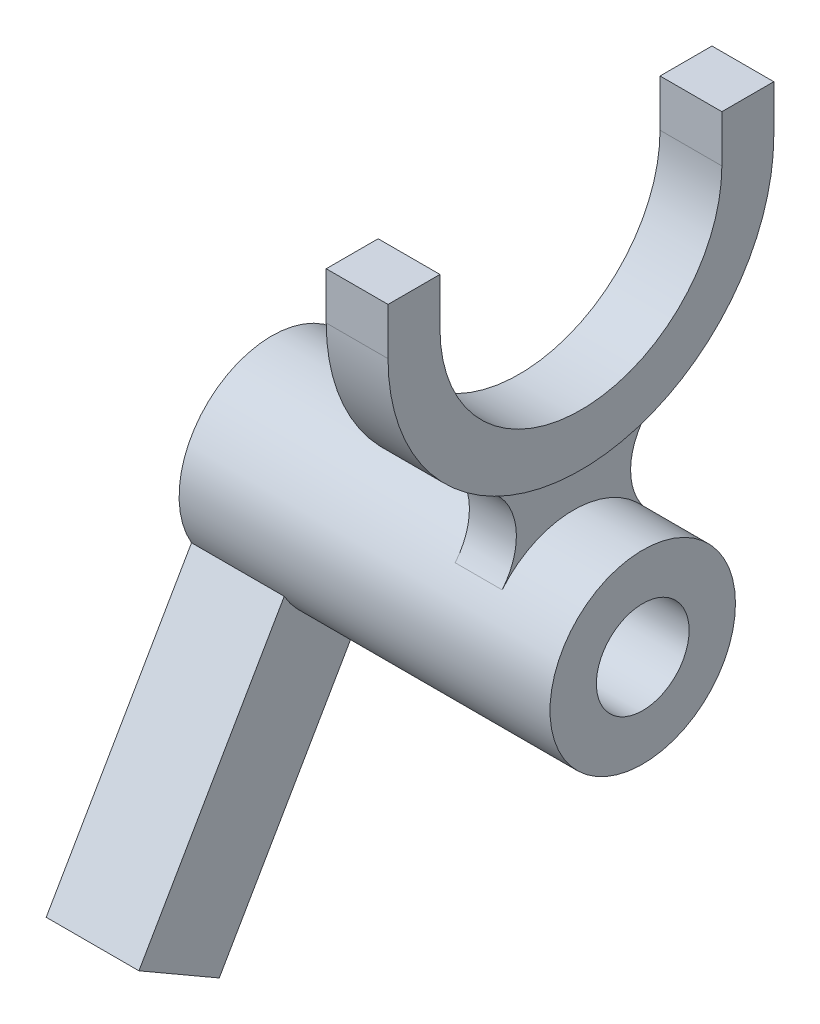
ISO-10303-21;
HEADER;
FILE_DESCRIPTION(('STEP AP214'),'2;1');
FILE_NAME('part.step','',(''),(''),'','','');
FILE_SCHEMA(('AUTOMOTIVE_DESIGN { 1 0 10303 214 1 1 1 1 }'));
ENDSEC;
DATA;
#1=APPLICATION_CONTEXT('core data for automotive mechanical design processes');
#2=APPLICATION_PROTOCOL_DEFINITION('international standard','automotive_design',2000,#1);
#3=PRODUCT_CONTEXT('',#1,'mechanical');
#4=PRODUCT('Part','Part','',(#3));
#5=PRODUCT_RELATED_PRODUCT_CATEGORY('part','',(#4));
#6=PRODUCT_DEFINITION_FORMATION('','',#4);
#7=PRODUCT_DEFINITION_CONTEXT('part definition',#1,'design');
#8=PRODUCT_DEFINITION('design','',#6,#7);
#9=PRODUCT_DEFINITION_SHAPE('','',#8);
#10=(LENGTH_UNIT() NAMED_UNIT(*) SI_UNIT(.MILLI.,.METRE.));
#11=(NAMED_UNIT(*) PLANE_ANGLE_UNIT() SI_UNIT($,.RADIAN.));
#12=(NAMED_UNIT(*) SI_UNIT($,.STERADIAN.) SOLID_ANGLE_UNIT());
#13=UNCERTAINTY_MEASURE_WITH_UNIT(LENGTH_MEASURE(1.E-05),#10,'distance_accuracy_value','');
#14=(GEOMETRIC_REPRESENTATION_CONTEXT(3) GLOBAL_UNCERTAINTY_ASSIGNED_CONTEXT((#13)) GLOBAL_UNIT_ASSIGNED_CONTEXT((#10,
#11,#12)) REPRESENTATION_CONTEXT('',''));
#15=CARTESIAN_POINT('',(0.,0.,0.));
#16=DIRECTION('',(0.,0.,1.));
#17=DIRECTION('',(1.,0.,0.));
#18=AXIS2_PLACEMENT_3D('',#15,#16,#17);
#19=CARTESIAN_POINT('',(-57.15,0.,0.));
#20=DIRECTION('',(1.,0.,0.));
#21=DIRECTION('',(0.,0.,-1.));
#22=AXIS2_PLACEMENT_3D('',#19,#20,#21);
#23=CYLINDRICAL_SURFACE('',#22,19.05);
#24=DIRECTION('',(-1.,0.,0.));
#25=VECTOR('',#24,1.);
#26=CARTESIAN_POINT('',(-38.1,-19.05,0.));
#27=LINE('',#26,#25);
#28=CARTESIAN_POINT('',(-38.1,-19.05,0.));
#29=VERTEX_POINT('',#28);
#30=CARTESIAN_POINT('',(-57.15,-19.05,0.));
#31=VERTEX_POINT('',#30);
#32=EDGE_CURVE('E176',#29,#31,#27,.T.);
#33=ORIENTED_EDGE('',*,*,#32,.T.);
#34=CARTESIAN_POINT('',(-57.15,0.,0.));
#35=DIRECTION('',(1.,0.,0.));
#36=DIRECTION('',(0.,0.,-1.));
#37=AXIS2_PLACEMENT_3D('',#34,#35,#36);
#38=CIRCLE('',#37,19.05);
#39=CARTESIAN_POINT('',(-57.15,-9.52499999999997,16.4977839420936));
#40=VERTEX_POINT('',#39);
#41=EDGE_CURVE('E11',#31,#40,#38,.T.);
#42=ORIENTED_EDGE('',*,*,#41,.T.);
#43=DIRECTION('',(-1.,0.,0.));
#44=VECTOR('',#43,1.);
#45=CARTESIAN_POINT('',(-38.1,-9.52499999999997,16.4977839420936));
#46=LINE('',#45,#44);
#47=CARTESIAN_POINT('',(-38.1,-9.52499999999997,16.4977839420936));
#48=VERTEX_POINT('',#47);
#49=EDGE_CURVE('E51',#48,#40,#46,.T.);
#50=ORIENTED_EDGE('',*,*,#49,.F.);
#51=CARTESIAN_POINT('',(-38.1,0.,0.));
#52=DIRECTION('',(1.,0.,0.));
#53=DIRECTION('',(0.,0.,1.));
#54=AXIS2_PLACEMENT_3D('',#51,#52,#53);
#55=CIRCLE('',#54,19.05);
#56=EDGE_CURVE('E47',#48,#29,#55,.T.);
#57=ORIENTED_EDGE('',*,*,#56,.T.);
#58=EDGE_LOOP('',(#33,#42,#50,#57));
#59=FACE_BOUND('',#58,.T.);
#60=CARTESIAN_POINT('',(4.826,0.,0.));
#61=DIRECTION('',(-1.,0.,0.));
#62=DIRECTION('',(0.,0.,-1.));
#63=AXIS2_PLACEMENT_3D('',#60,#61,#62);
#64=CIRCLE('',#63,19.05);
#65=CARTESIAN_POINT('',(4.826,12.1666969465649,14.6585806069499));
#66=VERTEX_POINT('',#65);
#67=CARTESIAN_POINT('',(4.826,12.1666969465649,-14.6585806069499));
#68=VERTEX_POINT('',#67);
#69=EDGE_CURVE('E246',#66,#68,#64,.T.);
#70=ORIENTED_EDGE('',*,*,#69,.F.);
#71=DIRECTION('',(-1.,0.,0.));
#72=VECTOR('',#71,1.);
#73=CARTESIAN_POINT('',(4.826,12.1666969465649,14.6585806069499));
#74=LINE('',#73,#72);
#75=CARTESIAN_POINT('',(-4.826,12.1666969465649,14.6585806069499));
#76=VERTEX_POINT('',#75);
#77=EDGE_CURVE('E264',#66,#76,#74,.T.);
#78=ORIENTED_EDGE('',*,*,#77,.T.);
#79=CARTESIAN_POINT('',(-4.826,0.,0.));
#80=DIRECTION('',(-1.,0.,0.));
#81=DIRECTION('',(0.,0.,-1.));
#82=AXIS2_PLACEMENT_3D('',#79,#80,#81);
#83=CIRCLE('',#82,19.05);
#84=CARTESIAN_POINT('',(-4.826,12.1666969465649,-14.6585806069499));
#85=VERTEX_POINT('',#84);
#86=EDGE_CURVE('E255',#76,#85,#83,.T.);
#87=ORIENTED_EDGE('',*,*,#86,.T.);
#88=DIRECTION('',(-1.,0.,0.));
#89=VECTOR('',#88,1.);
#90=CARTESIAN_POINT('',(4.826,12.1666969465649,-14.6585806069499));
#91=LINE('',#90,#89);
#92=EDGE_CURVE('E261',#68,#85,#91,.T.);
#93=ORIENTED_EDGE('',*,*,#92,.F.);
#94=EDGE_LOOP('',(#70,#78,#87,#93));
#95=FACE_BOUND('',#94,.T.);
#96=CARTESIAN_POINT('',(19.05,0.,0.));
#97=DIRECTION('',(1.,0.,0.));
#98=DIRECTION('',(0.,0.,-1.));
#99=AXIS2_PLACEMENT_3D('',#96,#97,#98);
#100=CIRCLE('',#99,19.05);
#101=CARTESIAN_POINT('',(19.05,0.,-19.05));
#102=VERTEX_POINT('',#101);
#103=EDGE_CURVE('E272',#102,#102,#100,.T.);
#104=ORIENTED_EDGE('',*,*,#103,.F.);
#105=EDGE_LOOP('',(#104));
#106=FACE_BOUND('',#105,.T.);
#107=ADVANCED_FACE('F33',(#59,#95,#106),#23,.T.);
#108=CARTESIAN_POINT('',(-57.15,0.,0.));
#109=DIRECTION('',(1.,0.,0.));
#110=DIRECTION('',(0.,0.,-1.));
#111=AXIS2_PLACEMENT_3D('',#108,#109,#110);
#112=PLANE('',#111);
#113=CARTESIAN_POINT('',(-57.15,0.,0.));
#114=DIRECTION('',(1.,0.,0.));
#115=DIRECTION('',(0.,0.,-1.));
#116=AXIS2_PLACEMENT_3D('',#113,#114,#115);
#117=CIRCLE('',#116,9.525);
#118=CARTESIAN_POINT('',(-57.15,0.,-9.525));
#119=VERTEX_POINT('',#118);
#120=EDGE_CURVE('E40',#119,#119,#117,.T.);
#121=ORIENTED_EDGE('',*,*,#120,.T.);
#122=EDGE_LOOP('',(#121));
#123=FACE_BOUND('',#122,.T.);
#124=ORIENTED_EDGE('',*,*,#41,.F.);
#125=DIRECTION('',(0.,-0.866025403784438,0.500000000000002));
#126=VECTOR('',#125,1.);
#127=CARTESIAN_POINT('',(-57.15,-70.7536357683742,29.8511080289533));
#128=LINE('',#127,#126);
#129=CARTESIAN_POINT('',(-57.15,-70.7536357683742,29.8511080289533));
#130=VERTEX_POINT('',#129);
#131=EDGE_CURVE('E164',#31,#130,#128,.T.);
#132=ORIENTED_EDGE('',*,*,#131,.T.);
#133=DIRECTION('',(0.,0.500000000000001,0.866025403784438));
#134=VECTOR('',#133,1.);
#135=CARTESIAN_POINT('',(-57.15,-61.2286357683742,46.3488919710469));
#136=LINE('',#135,#134);
#137=CARTESIAN_POINT('',(-57.15,-61.2286357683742,46.3488919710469));
#138=VERTEX_POINT('',#137);
#139=EDGE_CURVE('E171',#130,#138,#136,.T.);
#140=ORIENTED_EDGE('',*,*,#139,.T.);
#141=DIRECTION('',(0.,0.866025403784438,-0.500000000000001));
#142=VECTOR('',#141,1.);
#143=CARTESIAN_POINT('',(-57.15,-61.2286357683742,46.3488919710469));
#144=LINE('',#143,#142);
#145=EDGE_CURVE('E148',#138,#40,#144,.T.);
#146=ORIENTED_EDGE('',*,*,#145,.T.);
#147=EDGE_LOOP('',(#124,#132,#140,#146));
#148=FACE_BOUND('',#147,.T.);
#149=ADVANCED_FACE('F277',(#123,#148),#112,.F.);
#150=CARTESIAN_POINT('',(-57.15,0.,0.));
#151=DIRECTION('',(1.,0.,0.));
#152=DIRECTION('',(0.,0.,-1.));
#153=AXIS2_PLACEMENT_3D('',#150,#151,#152);
#154=CYLINDRICAL_SURFACE('',#153,9.525);
#155=ORIENTED_EDGE('',*,*,#120,.F.);
#156=EDGE_LOOP('',(#155));
#157=FACE_BOUND('',#156,.T.);
#158=CARTESIAN_POINT('',(19.05,0.,0.));
#159=DIRECTION('',(1.,0.,0.));
#160=DIRECTION('',(0.,0.,-1.));
#161=AXIS2_PLACEMENT_3D('',#158,#159,#160);
#162=CIRCLE('',#161,9.525);
#163=CARTESIAN_POINT('',(19.05,0.,-9.525));
#164=VERTEX_POINT('',#163);
#165=EDGE_CURVE('E269',#164,#164,#162,.T.);
#166=ORIENTED_EDGE('',*,*,#165,.T.);
#167=EDGE_LOOP('',(#166));
#168=FACE_BOUND('',#167,.T.);
#169=ADVANCED_FACE('F280',(#157,#168),#154,.F.);
#170=CARTESIAN_POINT('',(19.05,0.,0.));
#171=DIRECTION('',(1.,0.,0.));
#172=DIRECTION('',(0.,0.,-1.));
#173=AXIS2_PLACEMENT_3D('',#170,#171,#172);
#174=PLANE('',#173);
#175=ORIENTED_EDGE('',*,*,#103,.T.);
#176=EDGE_LOOP('',(#175));
#177=FACE_BOUND('',#176,.T.);
#178=ORIENTED_EDGE('',*,*,#165,.F.);
#179=EDGE_LOOP('',(#178));
#180=FACE_BOUND('',#179,.T.);
#181=ADVANCED_FACE('F283',(#177,#180),#174,.T.);
#182=CARTESIAN_POINT('',(4.826,20.2778282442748,24.4309676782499));
#183=DIRECTION('',(-1.,0.,0.));
#184=DIRECTION('',(0.,0.,1.));
#185=AXIS2_PLACEMENT_3D('',#182,#183,#184);
#186=CYLINDRICAL_SURFACE('',#185,12.7);
#187=CARTESIAN_POINT('',(-4.826,20.2778282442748,24.4309676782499));
#188=DIRECTION('',(-1.,0.,0.));
#189=DIRECTION('',(0.,0.,1.));
#190=AXIS2_PLACEMENT_3D('',#187,#188,#189);
#191=CIRCLE('',#190,12.7);
#192=CARTESIAN_POINT('',(-4.826,31.5084524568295,18.5011211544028));
#193=VERTEX_POINT('',#192);
#194=EDGE_CURVE('E253',#193,#76,#191,.T.);
#195=ORIENTED_EDGE('',*,*,#194,.T.);
#196=ORIENTED_EDGE('',*,*,#77,.F.);
#197=CARTESIAN_POINT('',(4.826,20.2778282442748,24.4309676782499));
#198=DIRECTION('',(-1.,0.,0.));
#199=DIRECTION('',(0.,0.,1.));
#200=AXIS2_PLACEMENT_3D('',#197,#198,#199);
#201=CIRCLE('',#200,12.7);
#202=CARTESIAN_POINT('',(4.826,31.5084524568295,18.5011211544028));
#203=VERTEX_POINT('',#202);
#204=EDGE_CURVE('E243',#203,#66,#201,.T.);
#205=ORIENTED_EDGE('',*,*,#204,.F.);
#206=DIRECTION('',(-1.,0.,0.));
#207=VECTOR('',#206,1.);
#208=CARTESIAN_POINT('',(4.826,31.5084524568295,18.5011211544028));
#209=LINE('',#208,#207);
#210=EDGE_CURVE('E267',#203,#193,#209,.T.);
#211=ORIENTED_EDGE('',*,*,#210,.T.);
#212=EDGE_LOOP('',(#195,#196,#205,#211));
#213=FACE_BOUND('',#212,.T.);
#214=ADVANCED_FACE('F288',(#213),#186,.F.);
#215=CARTESIAN_POINT('',(4.826,20.2778282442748,-24.4309676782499));
#216=DIRECTION('',(-1.,0.,0.));
#217=DIRECTION('',(0.,0.,1.));
#218=AXIS2_PLACEMENT_3D('',#215,#216,#217);
#219=CYLINDRICAL_SURFACE('',#218,12.7);
#220=CARTESIAN_POINT('',(-4.826,20.2778282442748,-24.4309676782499));
#221=DIRECTION('',(-1.,0.,0.));
#222=DIRECTION('',(0.,0.,-1.));
#223=AXIS2_PLACEMENT_3D('',#220,#221,#222);
#224=CIRCLE('',#223,12.7);
#225=CARTESIAN_POINT('',(-4.826,31.5084524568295,-18.5011211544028));
#226=VERTEX_POINT('',#225);
#227=EDGE_CURVE('E244',#85,#226,#224,.T.);
#228=ORIENTED_EDGE('',*,*,#227,.T.);
#229=DIRECTION('',(-1.,0.,0.));
#230=VECTOR('',#229,1.);
#231=CARTESIAN_POINT('',(4.826,31.5084524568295,-18.5011211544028));
#232=LINE('',#231,#230);
#233=CARTESIAN_POINT('',(4.826,31.5084524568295,-18.5011211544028));
#234=VERTEX_POINT('',#233);
#235=EDGE_CURVE('E250',#234,#226,#232,.T.);
#236=ORIENTED_EDGE('',*,*,#235,.F.);
#237=CARTESIAN_POINT('',(4.826,20.2778282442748,-24.4309676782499));
#238=DIRECTION('',(-1.,0.,0.));
#239=DIRECTION('',(0.,0.,-1.));
#240=AXIS2_PLACEMENT_3D('',#237,#238,#239);
#241=CIRCLE('',#240,12.7);
#242=EDGE_CURVE('E248',#68,#234,#241,.T.);
#243=ORIENTED_EDGE('',*,*,#242,.F.);
#244=ORIENTED_EDGE('',*,*,#92,.T.);
#245=EDGE_LOOP('',(#228,#236,#243,#244));
#246=FACE_BOUND('',#245,.T.);
#247=ADVANCED_FACE('F294',(#246),#219,.F.);
#248=CARTESIAN_POINT('',(4.826,43.4129141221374,-12.2154838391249));
#249=DIRECTION('',(1.,0.,0.));
#250=DIRECTION('',(0.,0.,-1.));
#251=AXIS2_PLACEMENT_3D('',#248,#249,#250);
#252=PLANE('',#251);
#253=CARTESIAN_POINT('',(4.826,66.548,0.));
#254=DIRECTION('',(-1.,0.,0.));
#255=DIRECTION('',(0.,0.,-1.));
#256=AXIS2_PLACEMENT_3D('',#253,#254,#255);
#257=CIRCLE('',#256,39.624);
#258=EDGE_CURVE('E240',#234,#203,#257,.T.);
#259=ORIENTED_EDGE('',*,*,#258,.T.);
#260=ORIENTED_EDGE('',*,*,#204,.T.);
#261=ORIENTED_EDGE('',*,*,#69,.T.);
#262=ORIENTED_EDGE('',*,*,#242,.T.);
#263=EDGE_LOOP('',(#259,#260,#261,#262));
#264=FACE_BOUND('',#263,.T.);
#265=ADVANCED_FACE('F310',(#264),#252,.T.);
#266=CARTESIAN_POINT('',(-4.826,43.4129141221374,-12.2154838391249));
#267=DIRECTION('',(1.,0.,0.));
#268=DIRECTION('',(0.,0.,-1.));
#269=AXIS2_PLACEMENT_3D('',#266,#267,#268);
#270=PLANE('',#269);
#271=CARTESIAN_POINT('',(-4.826,66.548,0.));
#272=DIRECTION('',(-1.,0.,0.));
#273=DIRECTION('',(0.,0.,-1.));
#274=AXIS2_PLACEMENT_3D('',#271,#272,#273);
#275=CIRCLE('',#274,39.624);
#276=EDGE_CURVE('E239',#226,#193,#275,.T.);
#277=ORIENTED_EDGE('',*,*,#276,.F.);
#278=ORIENTED_EDGE('',*,*,#227,.F.);
#279=ORIENTED_EDGE('',*,*,#86,.F.);
#280=ORIENTED_EDGE('',*,*,#194,.F.);
#281=EDGE_LOOP('',(#277,#278,#279,#280));
#282=FACE_BOUND('',#281,.T.);
#283=ADVANCED_FACE('F322',(#282),#270,.F.);
#284=CARTESIAN_POINT('',(6.35,66.548,-39.624));
#285=DIRECTION('',(0.,0.,1.));
#286=DIRECTION('',(1.,0.,0.));
#287=AXIS2_PLACEMENT_3D('',#284,#285,#286);
#288=PLANE('',#287);
#289=DIRECTION('',(0.,1.,0.));
#290=VECTOR('',#289,1.);
#291=CARTESIAN_POINT('',(-6.35,66.548,-39.624));
#292=LINE('',#291,#290);
#293=CARTESIAN_POINT('',(-6.35,66.548,-39.624));
#294=VERTEX_POINT('',#293);
#295=CARTESIAN_POINT('',(-6.35,76.2,-39.624));
#296=VERTEX_POINT('',#295);
#297=EDGE_CURVE('E175',#294,#296,#292,.T.);
#298=ORIENTED_EDGE('',*,*,#297,.T.);
#299=DIRECTION('',(-1.,0.,0.));
#300=VECTOR('',#299,1.);
#301=CARTESIAN_POINT('',(6.35,76.2,-39.624));
#302=LINE('',#301,#300);
#303=CARTESIAN_POINT('',(6.35,76.2,-39.624));
#304=VERTEX_POINT('',#303);
#305=EDGE_CURVE('E237',#304,#296,#302,.T.);
#306=ORIENTED_EDGE('',*,*,#305,.F.);
#307=DIRECTION('',(0.,1.,0.));
#308=VECTOR('',#307,1.);
#309=CARTESIAN_POINT('',(6.35,66.548,-39.624));
#310=LINE('',#309,#308);
#311=CARTESIAN_POINT('',(6.35,66.548,-39.624));
#312=VERTEX_POINT('',#311);
#313=EDGE_CURVE('E179',#312,#304,#310,.T.);
#314=ORIENTED_EDGE('',*,*,#313,.F.);
#315=DIRECTION('',(-1.,0.,0.));
#316=VECTOR('',#315,1.);
#317=CARTESIAN_POINT('',(6.35,66.548,-39.624));
#318=LINE('',#317,#316);
#319=EDGE_CURVE('E201',#312,#294,#318,.T.);
#320=ORIENTED_EDGE('',*,*,#319,.T.);
#321=EDGE_LOOP('',(#298,#306,#314,#320));
#322=FACE_BOUND('',#321,.T.);
#323=ADVANCED_FACE('F324',(#322),#288,.F.);
#324=CARTESIAN_POINT('',(6.35,76.2,-28.956));
#325=DIRECTION('',(0.,1.,0.));
#326=DIRECTION('',(0.,0.,1.));
#327=AXIS2_PLACEMENT_3D('',#324,#325,#326);
#328=PLANE('',#327);
#329=DIRECTION('',(0.,0.,-1.));
#330=VECTOR('',#329,1.);
#331=CARTESIAN_POINT('',(-6.35,76.2,-28.956));
#332=LINE('',#331,#330);
#333=CARTESIAN_POINT('',(-6.35,76.2,-28.956));
#334=VERTEX_POINT('',#333);
#335=EDGE_CURVE('E204',#334,#296,#332,.T.);
#336=ORIENTED_EDGE('',*,*,#335,.F.);
#337=DIRECTION('',(-1.,0.,0.));
#338=VECTOR('',#337,1.);
#339=CARTESIAN_POINT('',(6.35,76.2,-28.956));
#340=LINE('',#339,#338);
#341=CARTESIAN_POINT('',(6.35,76.2,-28.956));
#342=VERTEX_POINT('',#341);
#343=EDGE_CURVE('E235',#342,#334,#340,.T.);
#344=ORIENTED_EDGE('',*,*,#343,.F.);
#345=DIRECTION('',(0.,0.,-1.));
#346=VECTOR('',#345,1.);
#347=CARTESIAN_POINT('',(6.35,76.2,-28.956));
#348=LINE('',#347,#346);
#349=EDGE_CURVE('E181',#342,#304,#348,.T.);
#350=ORIENTED_EDGE('',*,*,#349,.T.);
#351=ORIENTED_EDGE('',*,*,#305,.T.);
#352=EDGE_LOOP('',(#336,#344,#350,#351));
#353=FACE_BOUND('',#352,.T.);
#354=ADVANCED_FACE('F330',(#353),#328,.T.);
#355=CARTESIAN_POINT('',(6.35,66.548,-28.956));
#356=DIRECTION('',(0.,0.,1.));
#357=DIRECTION('',(1.,0.,0.));
#358=AXIS2_PLACEMENT_3D('',#355,#356,#357);
#359=PLANE('',#358);
#360=DIRECTION('',(0.,1.,0.));
#361=VECTOR('',#360,1.);
#362=CARTESIAN_POINT('',(-6.35,66.548,-28.956));
#363=LINE('',#362,#361);
#364=CARTESIAN_POINT('',(-6.35,66.548,-28.956));
#365=VERTEX_POINT('',#364);
#366=EDGE_CURVE('E207',#365,#334,#363,.T.);
#367=ORIENTED_EDGE('',*,*,#366,.F.);
#368=DIRECTION('',(-1.,0.,0.));
#369=VECTOR('',#368,1.);
#370=CARTESIAN_POINT('',(6.35,66.548,-28.956));
#371=LINE('',#370,#369);
#372=CARTESIAN_POINT('',(6.35,66.548,-28.956));
#373=VERTEX_POINT('',#372);
#374=EDGE_CURVE('E233',#373,#365,#371,.T.);
#375=ORIENTED_EDGE('',*,*,#374,.F.);
#376=DIRECTION('',(0.,1.,0.));
#377=VECTOR('',#376,1.);
#378=CARTESIAN_POINT('',(6.35,66.548,-28.956));
#379=LINE('',#378,#377);
#380=EDGE_CURVE('E185',#373,#342,#379,.T.);
#381=ORIENTED_EDGE('',*,*,#380,.T.);
#382=ORIENTED_EDGE('',*,*,#343,.T.);
#383=EDGE_LOOP('',(#367,#375,#381,#382));
#384=FACE_BOUND('',#383,.T.);
#385=ADVANCED_FACE('F365',(#384),#359,.T.);
#386=CARTESIAN_POINT('',(6.35,66.548,0.));
#387=DIRECTION('',(-1.,0.,0.));
#388=DIRECTION('',(0.,0.,1.));
#389=AXIS2_PLACEMENT_3D('',#386,#387,#388);
#390=CYLINDRICAL_SURFACE('',#389,28.956);
#391=CARTESIAN_POINT('',(-6.35,66.548,0.));
#392=DIRECTION('',(1.,0.,0.));
#393=DIRECTION('',(0.,0.,-1.));
#394=AXIS2_PLACEMENT_3D('',#391,#392,#393);
#395=CIRCLE('',#394,28.956);
#396=CARTESIAN_POINT('',(-6.35,66.548,28.956));
#397=VERTEX_POINT('',#396);
#398=EDGE_CURVE('E210',#397,#365,#395,.T.);
#399=ORIENTED_EDGE('',*,*,#398,.F.);
#400=DIRECTION('',(-1.,0.,0.));
#401=VECTOR('',#400,1.);
#402=CARTESIAN_POINT('',(6.35,66.548,28.956));
#403=LINE('',#402,#401);
#404=CARTESIAN_POINT('',(6.35,66.548,28.956));
#405=VERTEX_POINT('',#404);
#406=EDGE_CURVE('E231',#405,#397,#403,.T.);
#407=ORIENTED_EDGE('',*,*,#406,.F.);
#408=CARTESIAN_POINT('',(6.35,66.548,0.));
#409=DIRECTION('',(1.,0.,0.));
#410=DIRECTION('',(0.,0.,-1.));
#411=AXIS2_PLACEMENT_3D('',#408,#409,#410);
#412=CIRCLE('',#411,28.956);
#413=EDGE_CURVE('E188',#405,#373,#412,.T.);
#414=ORIENTED_EDGE('',*,*,#413,.T.);
#415=ORIENTED_EDGE('',*,*,#374,.T.);
#416=EDGE_LOOP('',(#399,#407,#414,#415));
#417=FACE_BOUND('',#416,.T.);
#418=ADVANCED_FACE('F375',(#417),#390,.F.);
#419=CARTESIAN_POINT('',(6.35,66.548,28.956));
#420=DIRECTION('',(0.,0.,-1.));
#421=DIRECTION('',(-1.,0.,0.));
#422=AXIS2_PLACEMENT_3D('',#419,#420,#421);
#423=PLANE('',#422);
#424=DIRECTION('',(0.,1.,0.));
#425=VECTOR('',#424,1.);
#426=CARTESIAN_POINT('',(-6.35,66.548,28.956));
#427=LINE('',#426,#425);
#428=CARTESIAN_POINT('',(-6.35,76.2,28.956));
#429=VERTEX_POINT('',#428);
#430=EDGE_CURVE('E213',#429,#397,#427,.F.);
#431=ORIENTED_EDGE('',*,*,#430,.F.);
#432=DIRECTION('',(-1.,0.,0.));
#433=VECTOR('',#432,1.);
#434=CARTESIAN_POINT('',(6.35,76.2,28.956));
#435=LINE('',#434,#433);
#436=CARTESIAN_POINT('',(6.35,76.2,28.956));
#437=VERTEX_POINT('',#436);
#438=EDGE_CURVE('E229',#437,#429,#435,.T.);
#439=ORIENTED_EDGE('',*,*,#438,.F.);
#440=DIRECTION('',(0.,1.,0.));
#441=VECTOR('',#440,1.);
#442=CARTESIAN_POINT('',(6.35,66.548,28.956));
#443=LINE('',#442,#441);
#444=EDGE_CURVE('E191',#437,#405,#443,.F.);
#445=ORIENTED_EDGE('',*,*,#444,.T.);
#446=ORIENTED_EDGE('',*,*,#406,.T.);
#447=EDGE_LOOP('',(#431,#439,#445,#446));
#448=FACE_BOUND('',#447,.T.);
#449=ADVANCED_FACE('F385',(#448),#423,.T.);
#450=CARTESIAN_POINT('',(6.35,76.2,39.624));
#451=DIRECTION('',(0.,1.,0.));
#452=DIRECTION('',(0.,0.,1.));
#453=AXIS2_PLACEMENT_3D('',#450,#451,#452);
#454=PLANE('',#453);
#455=DIRECTION('',(0.,0.,-1.));
#456=VECTOR('',#455,1.);
#457=CARTESIAN_POINT('',(-6.35,76.2,39.624));
#458=LINE('',#457,#456);
#459=CARTESIAN_POINT('',(-6.35,76.2,39.624));
#460=VERTEX_POINT('',#459);
#461=EDGE_CURVE('E216',#460,#429,#458,.T.);
#462=ORIENTED_EDGE('',*,*,#461,.F.);
#463=DIRECTION('',(-1.,0.,0.));
#464=VECTOR('',#463,1.);
#465=CARTESIAN_POINT('',(6.35,76.2,39.624));
#466=LINE('',#465,#464);
#467=CARTESIAN_POINT('',(6.35,76.2,39.624));
#468=VERTEX_POINT('',#467);
#469=EDGE_CURVE('E227',#468,#460,#466,.T.);
#470=ORIENTED_EDGE('',*,*,#469,.F.);
#471=DIRECTION('',(0.,0.,-1.));
#472=VECTOR('',#471,1.);
#473=CARTESIAN_POINT('',(6.35,76.2,39.624));
#474=LINE('',#473,#472);
#475=EDGE_CURVE('E194',#468,#437,#474,.T.);
#476=ORIENTED_EDGE('',*,*,#475,.T.);
#477=ORIENTED_EDGE('',*,*,#438,.T.);
#478=EDGE_LOOP('',(#462,#470,#476,#477));
#479=FACE_BOUND('',#478,.T.);
#480=ADVANCED_FACE('F395',(#479),#454,.T.);
#481=CARTESIAN_POINT('',(6.35,66.548,39.624));
#482=DIRECTION('',(0.,0.,-1.));
#483=DIRECTION('',(-1.,0.,0.));
#484=AXIS2_PLACEMENT_3D('',#481,#482,#483);
#485=PLANE('',#484);
#486=DIRECTION('',(0.,-1.,0.));
#487=VECTOR('',#486,1.);
#488=CARTESIAN_POINT('',(-6.35,66.548,39.624));
#489=LINE('',#488,#487);
#490=CARTESIAN_POINT('',(-6.35,66.548,39.624));
#491=VERTEX_POINT('',#490);
#492=EDGE_CURVE('E219',#460,#491,#489,.T.);
#493=ORIENTED_EDGE('',*,*,#492,.T.);
#494=DIRECTION('',(-1.,0.,0.));
#495=VECTOR('',#494,1.);
#496=CARTESIAN_POINT('',(6.35,66.548,39.624));
#497=LINE('',#496,#495);
#498=CARTESIAN_POINT('',(6.35,66.548,39.624));
#499=VERTEX_POINT('',#498);
#500=EDGE_CURVE('E224',#499,#491,#497,.T.);
#501=ORIENTED_EDGE('',*,*,#500,.F.);
#502=DIRECTION('',(0.,-1.,0.));
#503=VECTOR('',#502,1.);
#504=CARTESIAN_POINT('',(6.35,66.548,39.624));
#505=LINE('',#504,#503);
#506=EDGE_CURVE('E197',#468,#499,#505,.T.);
#507=ORIENTED_EDGE('',*,*,#506,.F.);
#508=ORIENTED_EDGE('',*,*,#469,.T.);
#509=EDGE_LOOP('',(#493,#501,#507,#508));
#510=FACE_BOUND('',#509,.T.);
#511=ADVANCED_FACE('F405',(#510),#485,.F.);
#512=CARTESIAN_POINT('',(6.35,66.548,0.));
#513=DIRECTION('',(-1.,0.,0.));
#514=DIRECTION('',(0.,0.,1.));
#515=AXIS2_PLACEMENT_3D('',#512,#513,#514);
#516=CYLINDRICAL_SURFACE('',#515,39.624);
#517=ORIENTED_EDGE('',*,*,#258,.F.);
#518=ORIENTED_EDGE('',*,*,#235,.T.);
#519=ORIENTED_EDGE('',*,*,#276,.T.);
#520=ORIENTED_EDGE('',*,*,#210,.F.);
#521=EDGE_LOOP('',(#517,#518,#519,#520));
#522=FACE_BOUND('',#521,.T.);
#523=CARTESIAN_POINT('',(-6.35,66.548,0.));
#524=DIRECTION('',(1.,0.,0.));
#525=DIRECTION('',(0.,0.,1.));
#526=AXIS2_PLACEMENT_3D('',#523,#524,#525);
#527=CIRCLE('',#526,39.624);
#528=EDGE_CURVE('E182',#491,#294,#527,.T.);
#529=ORIENTED_EDGE('',*,*,#528,.T.);
#530=ORIENTED_EDGE('',*,*,#319,.F.);
#531=CARTESIAN_POINT('',(6.35,66.548,0.));
#532=DIRECTION('',(1.,0.,0.));
#533=DIRECTION('',(0.,0.,1.));
#534=AXIS2_PLACEMENT_3D('',#531,#532,#533);
#535=CIRCLE('',#534,39.624);
#536=EDGE_CURVE('E199',#499,#312,#535,.T.);
#537=ORIENTED_EDGE('',*,*,#536,.F.);
#538=ORIENTED_EDGE('',*,*,#500,.T.);
#539=EDGE_LOOP('',(#529,#530,#537,#538));
#540=FACE_BOUND('',#539,.T.);
#541=ADVANCED_FACE('F317',(#522,#540),#516,.T.);
#542=CARTESIAN_POINT('',(6.35,66.548,0.));
#543=DIRECTION('',(1.,0.,0.));
#544=DIRECTION('',(0.,0.,-1.));
#545=AXIS2_PLACEMENT_3D('',#542,#543,#544);
#546=PLANE('',#545);
#547=ORIENTED_EDGE('',*,*,#313,.T.);
#548=ORIENTED_EDGE('',*,*,#349,.F.);
#549=ORIENTED_EDGE('',*,*,#380,.F.);
#550=ORIENTED_EDGE('',*,*,#413,.F.);
#551=ORIENTED_EDGE('',*,*,#444,.F.);
#552=ORIENTED_EDGE('',*,*,#475,.F.);
#553=ORIENTED_EDGE('',*,*,#506,.T.);
#554=ORIENTED_EDGE('',*,*,#536,.T.);
#555=EDGE_LOOP('',(#547,#548,#549,#550,#551,#552,#553,#554));
#556=FACE_BOUND('',#555,.T.);
#557=ADVANCED_FACE('F424',(#556),#546,.T.);
#558=CARTESIAN_POINT('',(-6.35,66.548,0.));
#559=DIRECTION('',(1.,0.,0.));
#560=DIRECTION('',(0.,0.,-1.));
#561=AXIS2_PLACEMENT_3D('',#558,#559,#560);
#562=PLANE('',#561);
#563=ORIENTED_EDGE('',*,*,#297,.F.);
#564=ORIENTED_EDGE('',*,*,#528,.F.);
#565=ORIENTED_EDGE('',*,*,#492,.F.);
#566=ORIENTED_EDGE('',*,*,#461,.T.);
#567=ORIENTED_EDGE('',*,*,#430,.T.);
#568=ORIENTED_EDGE('',*,*,#398,.T.);
#569=ORIENTED_EDGE('',*,*,#366,.T.);
#570=ORIENTED_EDGE('',*,*,#335,.T.);
#571=EDGE_LOOP('',(#563,#564,#565,#566,#567,#568,#569,#570));
#572=FACE_BOUND('',#571,.T.);
#573=ADVANCED_FACE('F433',(#572),#562,.F.);
#574=CARTESIAN_POINT('',(-38.1,-61.2286357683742,46.3488919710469));
#575=DIRECTION('',(0.,-0.866025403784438,0.500000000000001));
#576=DIRECTION('',(0.,-0.500000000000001,-0.866025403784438));
#577=AXIS2_PLACEMENT_3D('',#574,#575,#576);
#578=PLANE('',#577);
#579=ORIENTED_EDGE('',*,*,#139,.F.);
#580=DIRECTION('',(-1.,0.,0.));
#581=VECTOR('',#580,1.);
#582=CARTESIAN_POINT('',(-38.1,-70.7536357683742,29.8511080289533));
#583=LINE('',#582,#581);
#584=CARTESIAN_POINT('',(-38.1,-70.7536357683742,29.8511080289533));
#585=VERTEX_POINT('',#584);
#586=EDGE_CURVE('E163',#585,#130,#583,.T.);
#587=ORIENTED_EDGE('',*,*,#586,.F.);
#588=DIRECTION('',(0.,0.500000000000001,0.866025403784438));
#589=VECTOR('',#588,1.);
#590=CARTESIAN_POINT('',(-38.1,-61.2286357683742,46.3488919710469));
#591=LINE('',#590,#589);
#592=CARTESIAN_POINT('',(-38.1,-61.2286357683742,46.3488919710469));
#593=VERTEX_POINT('',#592);
#594=EDGE_CURVE('E159',#585,#593,#591,.T.);
#595=ORIENTED_EDGE('',*,*,#594,.T.);
#596=DIRECTION('',(-1.,0.,0.));
#597=VECTOR('',#596,1.);
#598=CARTESIAN_POINT('',(-38.1,-61.2286357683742,46.3488919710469));
#599=LINE('',#598,#597);
#600=EDGE_CURVE('E143',#593,#138,#599,.T.);
#601=ORIENTED_EDGE('',*,*,#600,.T.);
#602=EDGE_LOOP('',(#579,#587,#595,#601));
#603=FACE_BOUND('',#602,.T.);
#604=ADVANCED_FACE('F162',(#603),#578,.T.);
#605=CARTESIAN_POINT('',(-38.1,-70.7536357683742,29.8511080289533));
#606=DIRECTION('',(0.,-0.500000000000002,-0.866025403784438));
#607=DIRECTION('',(0.,0.866025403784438,-0.500000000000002));
#608=AXIS2_PLACEMENT_3D('',#605,#606,#607);
#609=PLANE('',#608);
#610=ORIENTED_EDGE('',*,*,#131,.F.);
#611=ORIENTED_EDGE('',*,*,#32,.F.);
#612=DIRECTION('',(0.,-0.866025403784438,0.500000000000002));
#613=VECTOR('',#612,1.);
#614=CARTESIAN_POINT('',(-38.1,-70.7536357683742,29.8511080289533));
#615=LINE('',#614,#613);
#616=EDGE_CURVE('E153',#29,#585,#615,.T.);
#617=ORIENTED_EDGE('',*,*,#616,.T.);
#618=ORIENTED_EDGE('',*,*,#586,.T.);
#619=EDGE_LOOP('',(#610,#611,#617,#618));
#620=FACE_BOUND('',#619,.T.);
#621=ADVANCED_FACE('F463',(#620),#609,.T.);
#622=CARTESIAN_POINT('',(-38.1,-61.2286357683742,46.3488919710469));
#623=DIRECTION('',(0.,0.500000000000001,0.866025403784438));
#624=DIRECTION('',(0.,-0.866025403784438,0.500000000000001));
#625=AXIS2_PLACEMENT_3D('',#622,#623,#624);
#626=PLANE('',#625);
#627=ORIENTED_EDGE('',*,*,#145,.F.);
#628=ORIENTED_EDGE('',*,*,#600,.F.);
#629=DIRECTION('',(0.,0.866025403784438,-0.500000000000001));
#630=VECTOR('',#629,1.);
#631=CARTESIAN_POINT('',(-38.1,-61.2286357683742,46.3488919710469));
#632=LINE('',#631,#630);
#633=EDGE_CURVE('E146',#593,#48,#632,.T.);
#634=ORIENTED_EDGE('',*,*,#633,.T.);
#635=ORIENTED_EDGE('',*,*,#49,.T.);
#636=EDGE_LOOP('',(#627,#628,#634,#635));
#637=FACE_BOUND('',#636,.T.);
#638=ADVANCED_FACE('F145',(#637),#626,.T.);
#639=CARTESIAN_POINT('',(-38.1,0.,0.));
#640=DIRECTION('',(-1.,0.,0.));
#641=DIRECTION('',(0.,0.,1.));
#642=AXIS2_PLACEMENT_3D('',#639,#640,#641);
#643=PLANE('',#642);
#644=ORIENTED_EDGE('',*,*,#594,.F.);
#645=ORIENTED_EDGE('',*,*,#616,.F.);
#646=ORIENTED_EDGE('',*,*,#56,.F.);
#647=ORIENTED_EDGE('',*,*,#633,.F.);
#648=EDGE_LOOP('',(#644,#645,#646,#647));
#649=FACE_BOUND('',#648,.T.);
#650=ADVANCED_FACE('F157',(#649),#643,.F.);
#651=CLOSED_SHELL('',(#107,#149,#169,#181,#214,#247,#265,#283,#323,#354,#385,#418,#449,#480,
#511,#541,#557,#573,#604,#621,#638,#650));
#652=MANIFOLD_SOLID_BREP('B2',#651);
#653=ADVANCED_BREP_SHAPE_REPRESENTATION('',(#18,#652),#14);
#654=SHAPE_DEFINITION_REPRESENTATION(#9,#653);
ENDSEC;
END-ISO-10303-21;
